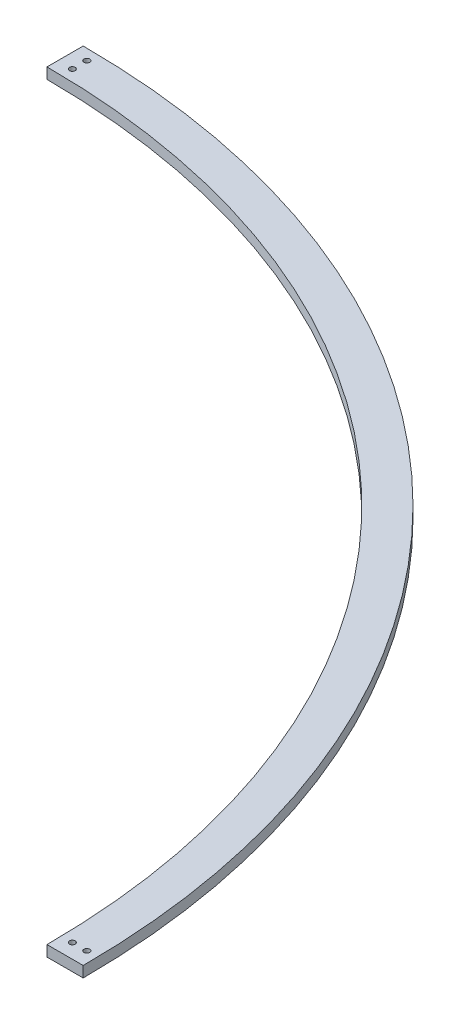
ISO-10303-21;
HEADER;
FILE_DESCRIPTION(('STEP AP214'),'2;1');
FILE_NAME('part.step','',(''),(''),'','','');
FILE_SCHEMA(('AUTOMOTIVE_DESIGN { 1 0 10303 214 1 1 1 1 }'));
ENDSEC;
DATA;
#1=APPLICATION_CONTEXT('core data for automotive mechanical design processes');
#2=APPLICATION_PROTOCOL_DEFINITION('international standard','automotive_design',2000,#1);
#3=PRODUCT_CONTEXT('',#1,'mechanical');
#4=PRODUCT('Part','Part','',(#3));
#5=PRODUCT_RELATED_PRODUCT_CATEGORY('part','',(#4));
#6=PRODUCT_DEFINITION_FORMATION('','',#4);
#7=PRODUCT_DEFINITION_CONTEXT('part definition',#1,'design');
#8=PRODUCT_DEFINITION('design','',#6,#7);
#9=PRODUCT_DEFINITION_SHAPE('','',#8);
#10=(LENGTH_UNIT() NAMED_UNIT(*) SI_UNIT(.MILLI.,.METRE.));
#11=(NAMED_UNIT(*) PLANE_ANGLE_UNIT() SI_UNIT($,.RADIAN.));
#12=(NAMED_UNIT(*) SI_UNIT($,.STERADIAN.) SOLID_ANGLE_UNIT());
#13=UNCERTAINTY_MEASURE_WITH_UNIT(LENGTH_MEASURE(1.E-05),#10,'distance_accuracy_value','');
#14=(GEOMETRIC_REPRESENTATION_CONTEXT(3) GLOBAL_UNCERTAINTY_ASSIGNED_CONTEXT((#13)) GLOBAL_UNIT_ASSIGNED_CONTEXT((#10,
#11,#12)) REPRESENTATION_CONTEXT('',''));
#15=CARTESIAN_POINT('',(0.,0.,0.));
#16=DIRECTION('',(0.,0.,1.));
#17=DIRECTION('',(1.,0.,0.));
#18=AXIS2_PLACEMENT_3D('',#15,#16,#17);
#19=CARTESIAN_POINT('',(0.,3.,0.));
#20=DIRECTION('',(0.,1.,0.));
#21=DIRECTION('',(0.,0.,1.));
#22=AXIS2_PLACEMENT_3D('',#19,#20,#21);
#23=PLANE('',#22);
#24=CARTESIAN_POINT('',(4.00000000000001,3.,-217.));
#25=DIRECTION('',(0.,1.,0.));
#26=DIRECTION('',(0.,0.,1.));
#27=AXIS2_PLACEMENT_3D('',#24,#25,#26);
#28=CIRCLE('',#27,0.799999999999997);
#29=CARTESIAN_POINT('',(4.00000000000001,3.,-216.2));
#30=VERTEX_POINT('',#29);
#31=EDGE_CURVE('E124',#30,#30,#28,.T.);
#32=ORIENTED_EDGE('',*,*,#31,.F.);
#33=EDGE_LOOP('',(#32));
#34=FACE_BOUND('',#33,.T.);
#35=CARTESIAN_POINT('',(217.,3.,-4.));
#36=DIRECTION('',(0.,1.,0.));
#37=DIRECTION('',(0.,0.,1.));
#38=AXIS2_PLACEMENT_3D('',#35,#36,#37);
#39=CIRCLE('',#38,0.799999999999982);
#40=CARTESIAN_POINT('',(217.,3.,-3.20000000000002));
#41=VERTEX_POINT('',#40);
#42=EDGE_CURVE('E103',#41,#41,#39,.T.);
#43=ORIENTED_EDGE('',*,*,#42,.F.);
#44=EDGE_LOOP('',(#43));
#45=FACE_BOUND('',#44,.T.);
#46=CARTESIAN_POINT('',(0.,3.,0.));
#47=DIRECTION('',(0.,1.,0.));
#48=DIRECTION('',(0.,0.,1.));
#49=AXIS2_PLACEMENT_3D('',#46,#47,#48);
#50=CIRCLE('',#49,220.);
#51=CARTESIAN_POINT('',(220.,3.,0.));
#52=VERTEX_POINT('',#51);
#53=CARTESIAN_POINT('',(0.,3.,-220.));
#54=VERTEX_POINT('',#53);
#55=EDGE_CURVE('E88',#52,#54,#50,.T.);
#56=ORIENTED_EDGE('',*,*,#55,.T.);
#57=DIRECTION('',(0.,0.,1.));
#58=VECTOR('',#57,1.);
#59=CARTESIAN_POINT('',(0.,3.,-220.));
#60=LINE('',#59,#58);
#61=CARTESIAN_POINT('',(0.,3.,-210.));
#62=VERTEX_POINT('',#61);
#63=EDGE_CURVE('E83',#54,#62,#60,.T.);
#64=ORIENTED_EDGE('',*,*,#63,.T.);
#65=CARTESIAN_POINT('',(0.,3.,0.));
#66=DIRECTION('',(0.,-1.,0.));
#67=DIRECTION('',(0.,0.,1.));
#68=AXIS2_PLACEMENT_3D('',#65,#66,#67);
#69=CIRCLE('',#68,210.);
#70=CARTESIAN_POINT('',(210.,3.,0.));
#71=VERTEX_POINT('',#70);
#72=EDGE_CURVE('E86',#62,#71,#69,.T.);
#73=ORIENTED_EDGE('',*,*,#72,.T.);
#74=DIRECTION('',(1.,0.,0.));
#75=VECTOR('',#74,1.);
#76=CARTESIAN_POINT('',(210.,3.,0.));
#77=LINE('',#76,#75);
#78=EDGE_CURVE('E53',#71,#52,#77,.T.);
#79=ORIENTED_EDGE('',*,*,#78,.T.);
#80=EDGE_LOOP('',(#56,#64,#73,#79));
#81=FACE_BOUND('',#80,.T.);
#82=CARTESIAN_POINT('',(213.,3.,-4.));
#83=DIRECTION('',(0.,1.,0.));
#84=DIRECTION('',(0.,0.,-1.));
#85=AXIS2_PLACEMENT_3D('',#82,#83,#84);
#86=CIRCLE('',#85,0.799999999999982);
#87=CARTESIAN_POINT('',(213.,3.,-4.79999999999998));
#88=VERTEX_POINT('',#87);
#89=EDGE_CURVE('E118',#88,#88,#86,.T.);
#90=ORIENTED_EDGE('',*,*,#89,.F.);
#91=EDGE_LOOP('',(#90));
#92=FACE_BOUND('',#91,.T.);
#93=CARTESIAN_POINT('',(4.00000000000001,3.,-213.));
#94=DIRECTION('',(0.,1.,0.));
#95=DIRECTION('',(0.,0.,-1.));
#96=AXIS2_PLACEMENT_3D('',#93,#94,#95);
#97=CIRCLE('',#96,0.799999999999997);
#98=CARTESIAN_POINT('',(4.00000000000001,3.,-213.8));
#99=VERTEX_POINT('',#98);
#100=EDGE_CURVE('E130',#99,#99,#97,.T.);
#101=ORIENTED_EDGE('',*,*,#100,.F.);
#102=EDGE_LOOP('',(#101));
#103=FACE_BOUND('',#102,.T.);
#104=ADVANCED_FACE('F36',(#34,#45,#81,#92,#103),#23,.T.);
#105=CARTESIAN_POINT('',(0.,0.,0.));
#106=DIRECTION('',(0.,1.,0.));
#107=DIRECTION('',(0.,0.,1.));
#108=AXIS2_PLACEMENT_3D('',#105,#106,#107);
#109=PLANE('',#108);
#110=CARTESIAN_POINT('',(0.,0.,0.));
#111=DIRECTION('',(0.,1.,0.));
#112=DIRECTION('',(0.,0.,1.));
#113=AXIS2_PLACEMENT_3D('',#110,#111,#112);
#114=CIRCLE('',#113,220.);
#115=CARTESIAN_POINT('',(220.,0.,0.));
#116=VERTEX_POINT('',#115);
#117=CARTESIAN_POINT('',(0.,0.,-220.));
#118=VERTEX_POINT('',#117);
#119=EDGE_CURVE('E100',#116,#118,#114,.T.);
#120=ORIENTED_EDGE('',*,*,#119,.F.);
#121=DIRECTION('',(1.,0.,0.));
#122=VECTOR('',#121,1.);
#123=CARTESIAN_POINT('',(210.,0.,0.));
#124=LINE('',#123,#122);
#125=CARTESIAN_POINT('',(210.,0.,0.));
#126=VERTEX_POINT('',#125);
#127=EDGE_CURVE('E76',#126,#116,#124,.T.);
#128=ORIENTED_EDGE('',*,*,#127,.F.);
#129=CARTESIAN_POINT('',(0.,0.,0.));
#130=DIRECTION('',(0.,-1.,0.));
#131=DIRECTION('',(0.,0.,1.));
#132=AXIS2_PLACEMENT_3D('',#129,#130,#131);
#133=CIRCLE('',#132,210.);
#134=CARTESIAN_POINT('',(0.,0.,-210.));
#135=VERTEX_POINT('',#134);
#136=EDGE_CURVE('E70',#135,#126,#133,.T.);
#137=ORIENTED_EDGE('',*,*,#136,.F.);
#138=DIRECTION('',(0.,0.,1.));
#139=VECTOR('',#138,1.);
#140=CARTESIAN_POINT('',(0.,0.,-220.));
#141=LINE('',#140,#139);
#142=EDGE_CURVE('E92',#118,#135,#141,.T.);
#143=ORIENTED_EDGE('',*,*,#142,.F.);
#144=EDGE_LOOP('',(#120,#128,#137,#143));
#145=FACE_BOUND('',#144,.T.);
#146=CARTESIAN_POINT('',(217.,0.,-4.));
#147=DIRECTION('',(0.,1.,0.));
#148=DIRECTION('',(0.,0.,1.));
#149=AXIS2_PLACEMENT_3D('',#146,#147,#148);
#150=CIRCLE('',#149,0.799999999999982);
#151=CARTESIAN_POINT('',(217.,0.,-3.20000000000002));
#152=VERTEX_POINT('',#151);
#153=EDGE_CURVE('E115',#152,#152,#150,.T.);
#154=ORIENTED_EDGE('',*,*,#153,.T.);
#155=EDGE_LOOP('',(#154));
#156=FACE_BOUND('',#155,.T.);
#157=CARTESIAN_POINT('',(213.,0.,-4.));
#158=DIRECTION('',(0.,1.,0.));
#159=DIRECTION('',(0.,0.,-1.));
#160=AXIS2_PLACEMENT_3D('',#157,#158,#159);
#161=CIRCLE('',#160,0.799999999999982);
#162=CARTESIAN_POINT('',(213.,0.,-4.79999999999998));
#163=VERTEX_POINT('',#162);
#164=EDGE_CURVE('E121',#163,#163,#161,.T.);
#165=ORIENTED_EDGE('',*,*,#164,.T.);
#166=EDGE_LOOP('',(#165));
#167=FACE_BOUND('',#166,.T.);
#168=CARTESIAN_POINT('',(4.00000000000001,0.,-217.));
#169=DIRECTION('',(0.,1.,0.));
#170=DIRECTION('',(0.,0.,1.));
#171=AXIS2_PLACEMENT_3D('',#168,#169,#170);
#172=CIRCLE('',#171,0.799999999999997);
#173=CARTESIAN_POINT('',(4.00000000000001,0.,-216.2));
#174=VERTEX_POINT('',#173);
#175=EDGE_CURVE('E127',#174,#174,#172,.T.);
#176=ORIENTED_EDGE('',*,*,#175,.T.);
#177=EDGE_LOOP('',(#176));
#178=FACE_BOUND('',#177,.T.);
#179=CARTESIAN_POINT('',(4.00000000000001,0.,-213.));
#180=DIRECTION('',(0.,1.,0.));
#181=DIRECTION('',(0.,0.,-1.));
#182=AXIS2_PLACEMENT_3D('',#179,#180,#181);
#183=CIRCLE('',#182,0.799999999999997);
#184=CARTESIAN_POINT('',(4.00000000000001,0.,-213.8));
#185=VERTEX_POINT('',#184);
#186=EDGE_CURVE('E133',#185,#185,#183,.T.);
#187=ORIENTED_EDGE('',*,*,#186,.T.);
#188=EDGE_LOOP('',(#187));
#189=FACE_BOUND('',#188,.T.);
#190=ADVANCED_FACE('F111',(#145,#156,#167,#178,#189),#109,.F.);
#191=CARTESIAN_POINT('',(0.,3.,0.));
#192=DIRECTION('',(0.,-1.,0.));
#193=DIRECTION('',(0.,0.,-1.));
#194=AXIS2_PLACEMENT_3D('',#191,#192,#193);
#195=CYLINDRICAL_SURFACE('',#194,220.);
#196=ORIENTED_EDGE('',*,*,#119,.T.);
#197=DIRECTION('',(0.,-1.,0.));
#198=VECTOR('',#197,1.);
#199=CARTESIAN_POINT('',(0.,3.,-220.));
#200=LINE('',#199,#198);
#201=EDGE_CURVE('E11',#54,#118,#200,.T.);
#202=ORIENTED_EDGE('',*,*,#201,.F.);
#203=ORIENTED_EDGE('',*,*,#55,.F.);
#204=DIRECTION('',(0.,-1.,0.));
#205=VECTOR('',#204,1.);
#206=CARTESIAN_POINT('',(220.,3.,0.));
#207=LINE('',#206,#205);
#208=EDGE_CURVE('E96',#52,#116,#207,.T.);
#209=ORIENTED_EDGE('',*,*,#208,.T.);
#210=EDGE_LOOP('',(#196,#202,#203,#209));
#211=FACE_BOUND('',#210,.T.);
#212=ADVANCED_FACE('F38',(#211),#195,.T.);
#213=CARTESIAN_POINT('',(0.,3.,-220.));
#214=DIRECTION('',(1.,0.,0.));
#215=DIRECTION('',(0.,0.,-1.));
#216=AXIS2_PLACEMENT_3D('',#213,#214,#215);
#217=PLANE('',#216);
#218=ORIENTED_EDGE('',*,*,#142,.T.);
#219=DIRECTION('',(0.,-1.,0.));
#220=VECTOR('',#219,1.);
#221=CARTESIAN_POINT('',(0.,3.,-210.));
#222=LINE('',#221,#220);
#223=EDGE_CURVE('E45',#62,#135,#222,.T.);
#224=ORIENTED_EDGE('',*,*,#223,.F.);
#225=ORIENTED_EDGE('',*,*,#63,.F.);
#226=ORIENTED_EDGE('',*,*,#201,.T.);
#227=EDGE_LOOP('',(#218,#224,#225,#226));
#228=FACE_BOUND('',#227,.T.);
#229=ADVANCED_FACE('F91',(#228),#217,.F.);
#230=CARTESIAN_POINT('',(0.,3.,0.));
#231=DIRECTION('',(0.,-1.,0.));
#232=DIRECTION('',(0.,0.,-1.));
#233=AXIS2_PLACEMENT_3D('',#230,#231,#232);
#234=CYLINDRICAL_SURFACE('',#233,210.);
#235=ORIENTED_EDGE('',*,*,#136,.T.);
#236=DIRECTION('',(0.,-1.,0.));
#237=VECTOR('',#236,1.);
#238=CARTESIAN_POINT('',(210.,3.,0.));
#239=LINE('',#238,#237);
#240=EDGE_CURVE('E93',#71,#126,#239,.T.);
#241=ORIENTED_EDGE('',*,*,#240,.F.);
#242=ORIENTED_EDGE('',*,*,#72,.F.);
#243=ORIENTED_EDGE('',*,*,#223,.T.);
#244=EDGE_LOOP('',(#235,#241,#242,#243));
#245=FACE_BOUND('',#244,.T.);
#246=ADVANCED_FACE('F94',(#245),#234,.F.);
#247=CARTESIAN_POINT('',(210.,3.,0.));
#248=DIRECTION('',(0.,0.,-1.));
#249=DIRECTION('',(-1.,0.,0.));
#250=AXIS2_PLACEMENT_3D('',#247,#248,#249);
#251=PLANE('',#250);
#252=ORIENTED_EDGE('',*,*,#127,.T.);
#253=ORIENTED_EDGE('',*,*,#208,.F.);
#254=ORIENTED_EDGE('',*,*,#78,.F.);
#255=ORIENTED_EDGE('',*,*,#240,.T.);
#256=EDGE_LOOP('',(#252,#253,#254,#255));
#257=FACE_BOUND('',#256,.T.);
#258=ADVANCED_FACE('F108',(#257),#251,.F.);
#259=CARTESIAN_POINT('',(217.,3.,-4.));
#260=DIRECTION('',(0.,-1.,0.));
#261=DIRECTION('',(0.,0.,-1.));
#262=AXIS2_PLACEMENT_3D('',#259,#260,#261);
#263=CYLINDRICAL_SURFACE('',#262,0.799999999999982);
#264=ORIENTED_EDGE('',*,*,#42,.T.);
#265=EDGE_LOOP('',(#264));
#266=FACE_BOUND('',#265,.T.);
#267=ORIENTED_EDGE('',*,*,#153,.F.);
#268=EDGE_LOOP('',(#267));
#269=FACE_BOUND('',#268,.T.);
#270=ADVANCED_FACE('F152',(#266,#269),#263,.F.);
#271=CARTESIAN_POINT('',(213.,3.,-4.));
#272=DIRECTION('',(0.,-1.,0.));
#273=DIRECTION('',(0.,0.,-1.));
#274=AXIS2_PLACEMENT_3D('',#271,#272,#273);
#275=CYLINDRICAL_SURFACE('',#274,0.799999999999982);
#276=ORIENTED_EDGE('',*,*,#89,.T.);
#277=EDGE_LOOP('',(#276));
#278=FACE_BOUND('',#277,.T.);
#279=ORIENTED_EDGE('',*,*,#164,.F.);
#280=EDGE_LOOP('',(#279));
#281=FACE_BOUND('',#280,.T.);
#282=ADVANCED_FACE('F208',(#278,#281),#275,.F.);
#283=CARTESIAN_POINT('',(4.00000000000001,3.,-217.));
#284=DIRECTION('',(0.,-1.,0.));
#285=DIRECTION('',(0.,0.,-1.));
#286=AXIS2_PLACEMENT_3D('',#283,#284,#285);
#287=CYLINDRICAL_SURFACE('',#286,0.799999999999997);
#288=ORIENTED_EDGE('',*,*,#31,.T.);
#289=EDGE_LOOP('',(#288));
#290=FACE_BOUND('',#289,.T.);
#291=ORIENTED_EDGE('',*,*,#175,.F.);
#292=EDGE_LOOP('',(#291));
#293=FACE_BOUND('',#292,.T.);
#294=ADVANCED_FACE('F216',(#290,#293),#287,.F.);
#295=CARTESIAN_POINT('',(4.00000000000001,3.,-213.));
#296=DIRECTION('',(0.,-1.,0.));
#297=DIRECTION('',(0.,0.,-1.));
#298=AXIS2_PLACEMENT_3D('',#295,#296,#297);
#299=CYLINDRICAL_SURFACE('',#298,0.799999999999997);
#300=ORIENTED_EDGE('',*,*,#100,.T.);
#301=EDGE_LOOP('',(#300));
#302=FACE_BOUND('',#301,.T.);
#303=ORIENTED_EDGE('',*,*,#186,.F.);
#304=EDGE_LOOP('',(#303));
#305=FACE_BOUND('',#304,.T.);
#306=ADVANCED_FACE('F139',(#302,#305),#299,.F.);
#307=CLOSED_SHELL('',(#104,#190,#212,#229,#246,#258,#270,#282,#294,#306));
#308=MANIFOLD_SOLID_BREP('B2',#307);
#309=ADVANCED_BREP_SHAPE_REPRESENTATION('',(#18,#308),#14);
#310=SHAPE_DEFINITION_REPRESENTATION(#9,#309);
ENDSEC;
END-ISO-10303-21;
